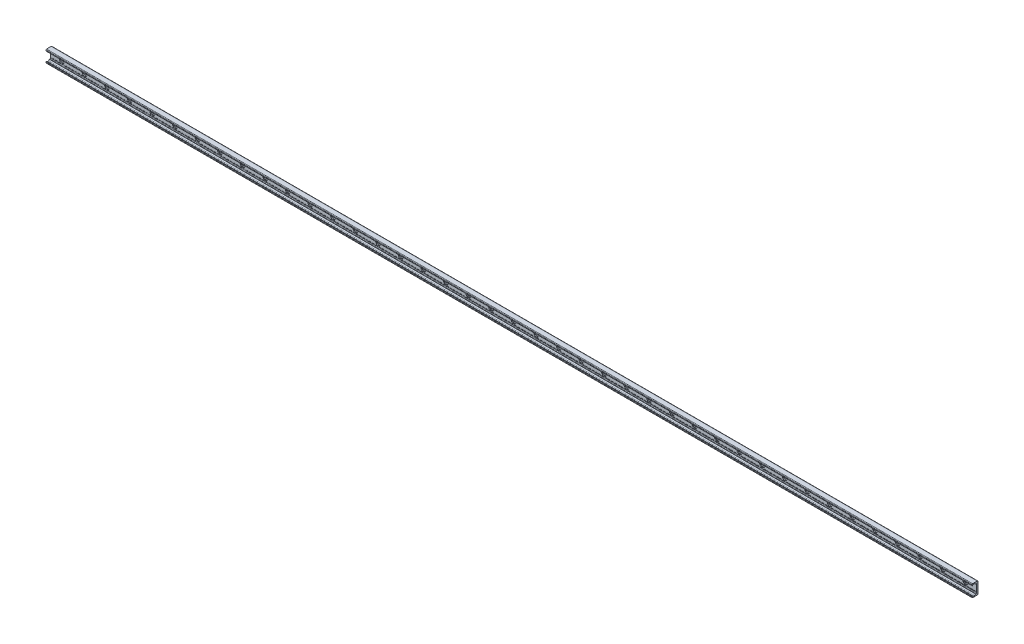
from build123d import *

# Parameters (mm, degrees)
BOSS_EXTRUDE1_DEPTH = 1640
SKETCH2_R           = 9
SKETCH2_R_2         = 4.5
CUT_EXTRUDE1_DEPTH  = 3.1
SKETCH2_2_R         = 4.5
CUT_EXTRUDE2_DEPTH  = 1641.223917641
LPATTERN1_COUNT     = 41
LPATTERN1_PITCH     = 80


with BuildPart() as part:
    # Sketch1 → Boss-Extrude1 (new, symmetric)
    with BuildSketch(Plane(origin=(0, 0, 0), x_dir=(0, 0, -1), z_dir=(1, 0, 0))):
        with BuildLine():
            Line((0, 0), (0, 19))
            ThreePointArc((0, 19), (-0.732233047, 20.767766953), (-2.5, 21.5))
            Line((-2.5, 21.5), (-19, 21.5))
            ThreePointArc((-19, 21.5), (-20.414213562, 20.914213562), (-21, 19.5))
            Line((-21, 19.5), (-21, 16.625057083))
            ThreePointArc((-21, 16.625057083), (-20.553251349, 15.888838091), (-19.693931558, 15.945160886))
            Line((-19.693931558, 15.945160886), (-16.794305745, 17.975500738))
            ThreePointArc((-16.794305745, 17.975500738), (-14.5, 18.69889256), (-12.205694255, 17.975500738))
            Line((-12.205694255, 17.975500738), (-8.829831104, 15.611695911))
            ThreePointArc((-8.829831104, 15.611695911), (-8.28408983, 15.342566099), (-7.682678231, 15.25))
            Line((-7.682678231, 15.25), (-6.5, 15.25))
            ThreePointArc((-6.5, 15.25), (-5.085786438, 14.664213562), (-4.5, 13.25))
            Line((-4.5, 13.25), (-4.5, -10.75))
            ThreePointArc((-4.5, -10.75), (-4.25, -11), (-4.5, -11.25))
            Line((-4.5, -11.25), (-4.5, -12.25))
            ThreePointArc((-4.5, -12.25), (-4.25, -12.5), (-4.5, -12.75))
            Line((-4.5, -12.75), (-4.5, -13.25))
            ThreePointArc((-4.5, -13.25), (-5.085786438, -14.664213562), (-6.5, -15.25))
            Line((-6.5, -15.25), (-7.682678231, -15.25))
            ThreePointArc((-7.682678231, -15.25), (-8.28408983, -15.342566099), (-8.829831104, -15.611695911))
            Line((-8.829831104, -15.611695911), (-12.205694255, -17.975500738))
            ThreePointArc((-12.205694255, -17.975500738), (-14.5, -18.69889256), (-16.794305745, -17.975500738))
            Line((-16.794305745, -17.975500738), (-19.693931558, -15.945160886))
            ThreePointArc((-19.693931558, -15.945160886), (-20.553251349, -15.888838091), (-21, -16.625057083))
            Line((-21, -16.625057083), (-21, -19.5))
            ThreePointArc((-21, -19.5), (-20.414213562, -20.914213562), (-19, -21.5))
            Line((-19, -21.5), (-2.5, -21.5))
            ThreePointArc((-2.5, -21.5), (-0.732233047, -20.767766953), (0, -19))
            Line((0, -19), (0, 0))
        make_face()
    extrude(amount=BOSS_EXTRUDE1_DEPTH, both=True)

    # Sketch2 → Cut-Extrude1 (cut)
    with BuildSketch(Plane.XY.offset(4.5)):
        with Locations((1600, 0)):
            Circle(SKETCH2_R)
        with Locations((1600, 0)):
            Circle(SKETCH2_R_2, mode=Mode.SUBTRACT)
    cut_extrude1 = extrude(amount=-CUT_EXTRUDE1_DEPTH, mode=Mode.SUBTRACT)

    # Sketch2_2 → Cut-Extrude2 (cut, through all)
    with BuildSketch(Plane.XY.offset(4.5)):
        with Locations((1600, 0)):
            Circle(SKETCH2_2_R)
    cut_extrude2 = extrude(amount=-CUT_EXTRUDE2_DEPTH, mode=Mode.SUBTRACT)

    # LPattern1: Cut-Extrude1, Cut-Extrude2 ×41
    with Locations(*[(-i * LPATTERN1_PITCH, 0, 0) for i in range(1, LPATTERN1_COUNT)]):
        add(cut_extrude1, mode=Mode.SUBTRACT)
        add(cut_extrude2, mode=Mode.SUBTRACT)


solid = part.part
